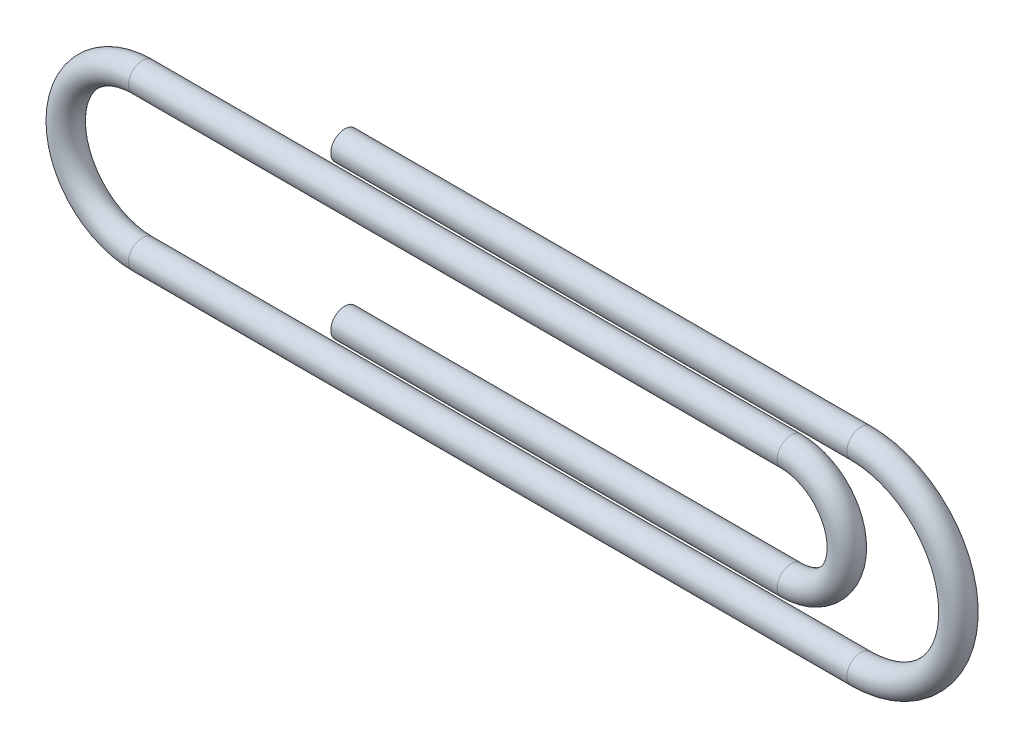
from build123d import *

# Parameters (mm, degrees)
SKETCH2_R = 0.5


with BuildPart() as part:
    # Sweep1: sweep along a path in Sketch1
    with BuildLine(Plane.XY) as sweep1_path:
        Line((0, 0), (16, 0))
        ThreePointArc((16, 0), (18, 2), (16, 4))
        Line((16, 4), (-7.25, 4))
        ThreePointArc((-7.25, 4), (-10, 1.25), (-7.25, -1.5))
        Line((-7.25, -1.5), (18.5, -1.5))
        ThreePointArc((18.5, -1.5), (22, 2), (18.5, 5.5))
        Line((18.5, 5.5), (0, 5.5))
    # Sketch2 → Sweep1 (sweep)
    with BuildSketch(Plane(origin=(0, 0, 0), x_dir=(0, 0, -1), z_dir=(1, 0, 0))):
        Circle(SKETCH2_R)
    sweep(path=sweep1_path.line)


solid = part.part
